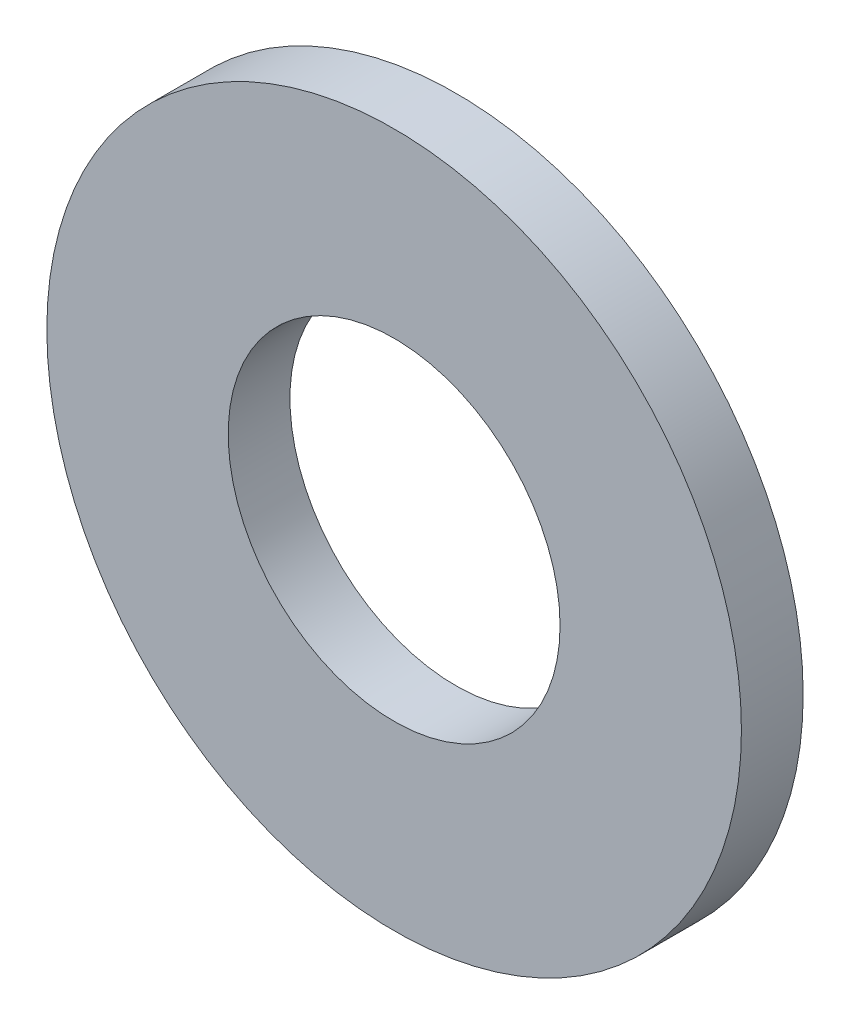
from build123d import *

# Parameters (mm, degrees)
SKETCH_1_R            = 4.5
SKETCH_1_R_2          = 2.15
WASHER_ENVELOPE_DEPTH = 0.8


with BuildPart() as part:
    # Sketch 1 → Washer_envelope (new body)
    with BuildSketch(Plane.XY):
        Circle(SKETCH_1_R)
        Circle(SKETCH_1_R_2, mode=Mode.SUBTRACT)
    extrude(amount=WASHER_ENVELOPE_DEPTH)


solid = part.part
